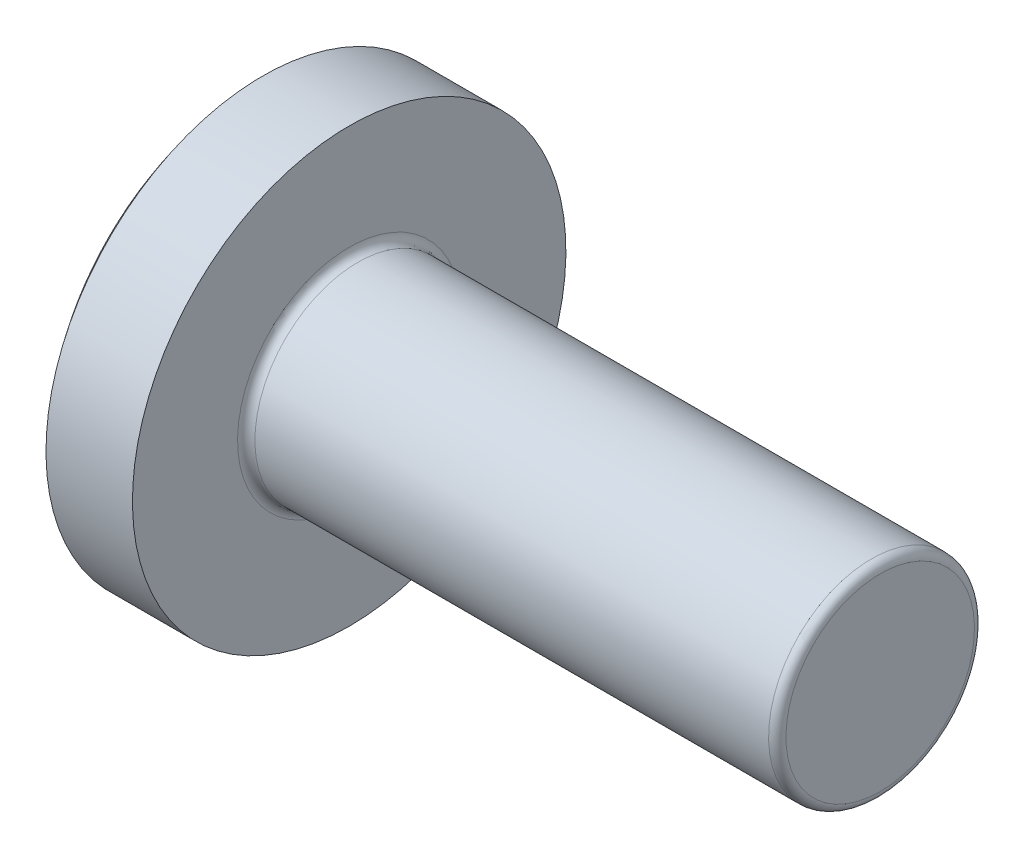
from build123d import *

# Parameters (mm, degrees)
CUT_EXTRUDE1_DEPTH = 5.2
FILLET1_R          = 0.4
DRAFT1_ANGLE       = -30


with BuildPart() as part:
    # Sketch1 → Base (revolve)
    with BuildSketch(Plane.XY, mode=Mode.PRIVATE) as base_sk:
        with BuildLine():
            Line((32, 0), (32, 4.75))
            Line((32, 4.75), (7.5, 4.75))
            Line((7.5, 4.75), (7.5, 10))
            Line((7.5, 10), (3.510004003, 10))
            ThreePointArc((3.510004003, 10), (0.902981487, 5.299059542), (0, 0))
            Line((0, 0), (32, 0))
        make_face()
    revolve(base_sk.sketch.rotate(Axis((-8.635649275, 0, 0), (1, 0, 0)), 180), axis=Axis((-8.635649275, 0, 0), (1, 0, 0)))

    # Sketch2 → Cut-Extrude1 (cut)
    with BuildSketch(Plane(origin=(0, 0, 0), x_dir=(0, 0, -1), z_dir=(1, 0, 0))):
        Polygon((-1.01, 5.05), (1.01, 5.05), (1.01, 1.01), (5.05, 1.01), (5.05, -1.01), (1.01, -1.01), (1.01, -5.05), (-1.01, -5.05), (-1.01, -1.01), (-5.05, -1.01), (-5.05, 1.01), (-1.01, 1.01), align=None)
    extrude(amount=CUT_EXTRUDE1_DEPTH, mode=Mode.SUBTRACT)

    # Fillet1
    fillet1_edges = [part.edges().sort_by_distance(p)[0] for p in [
        (7.5, 4.75, 0),
        (32, 4.75, 0),
    ]]
    fillet(fillet1_edges, radius=FILLET1_R)

    # Draft1
    draft1_faces = [part.faces().sort_by_distance(p)[0] for p in [
        (3.014519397, 5.05, 0),
        (3.014519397, 0, 5.05),
        (3.014519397, -5.05, 0),
        (3.014519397, 0, -5.05),
    ]]
    draft(draft1_faces, Plane(origin=(0, 0, 0), x_dir=(0, 0, 1), z_dir=(1, 0, 0)), DRAFT1_ANGLE)


solid = part.part
